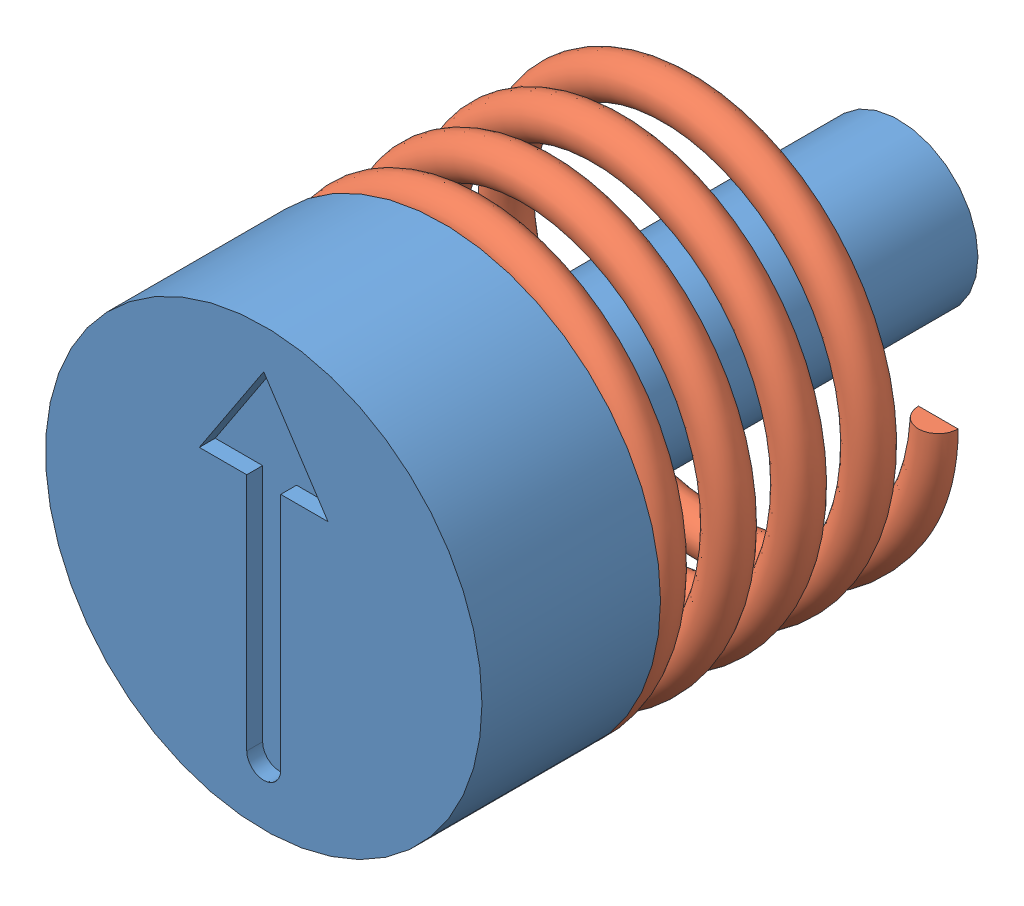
SolidWorks assembly DCP20-AO.SLDASM, configuration Default (file format 10000). Lengths in mm.
Overall size (11.29 11.58 16).
2 component instances, 2 part files, 2 mates.
Components (placement in the parent):
- DCP20-AO-1: DCP20-AO.sldprt [Default] at origin size (11 11 16)
- DCSPR20-1: DCSPR20.SLDPRT [Default] at (0 0 -12) size (11.29 11.58 8.5)
Mates (geometry in assembly coordinates):
- Coincident1: coincident anti-aligned: plane of DCP20-AO-1 through (5.5 0 -4.5) normal (0 0 -1); plane of DCSPR20-1 through (5.5 -5.783 -4.5) normal (0 0 1)
- Concentric1: concentric aligned: cylinder of DCP20-AO-1 through (0 0 0) axis (0 0 1) radius 2; line of DCSPR20-1 through (0 0 -12.96) axis (0 0 1)
